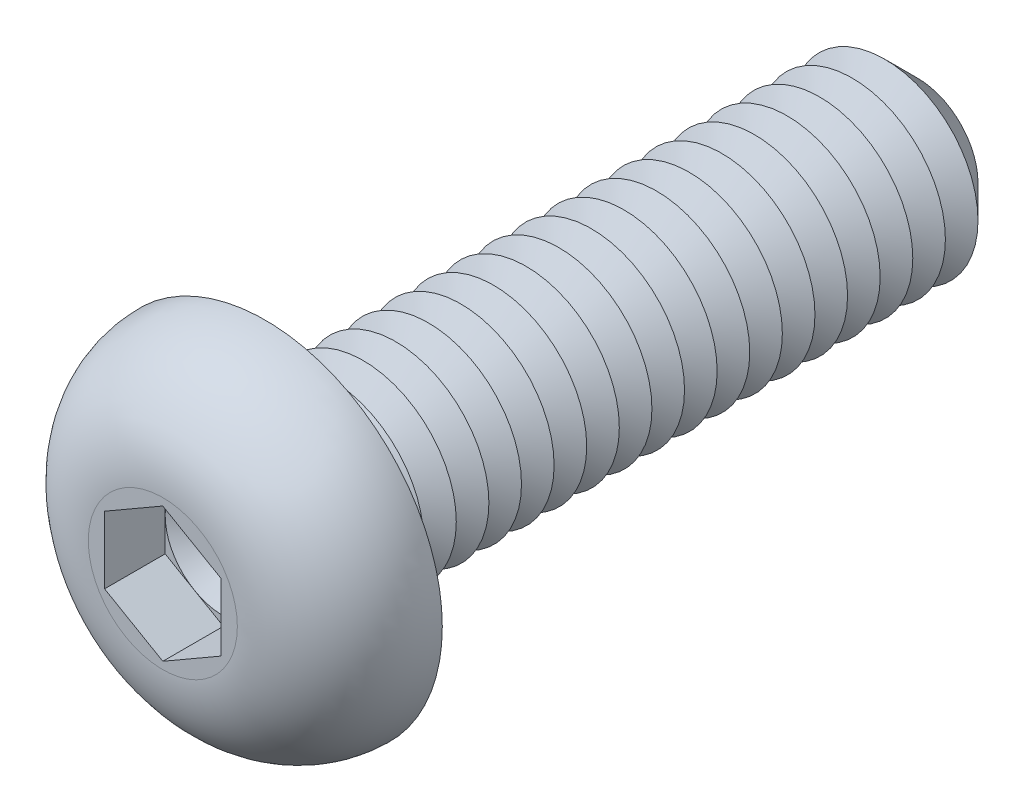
from build123d import *

# Parameters (mm, degrees)
CUT_EXTRUDE1_DEPTH  = 1.3
SKETCH4_R           = 2
BOSS_EXTRUDE1_DEPTH = 14
CHAMFER1_SIZE       = 0.7
LPATTERN1_COUNT     = 18
LPATTERN1_PITCH     = 0.7
FILLET2_R           = 0.3


with BuildPart() as part:
    # Sketch2 → Revolve1 (revolve)
    with BuildSketch(Plane(origin=(0, 0, 0), x_dir=(0, 0, -1), z_dir=(1, 0, 0)), mode=Mode.PRIVATE) as revolve1_sk:
        with BuildLine():
            Line((0, 0), (-2.2, 0))
            Line((-2.2, 0), (-2.2, 1.6))
            ThreePointArc((-2.2, 1.6), (-1.555634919, 3.155634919), (0, 3.8))
            Line((0, 3.8), (0, 0))
        make_face()
    revolve(revolve1_sk.sketch.rotate(Axis((0, 0, 47.934239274), (0, 0, -1)), 90), axis=Axis((0, 0, 47.934239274), (0, 0, -1)))

    # Sketch3 → Cut-Extrude1 (cut)
    with BuildSketch(Plane.XY.offset(2.2)):
        Polygon((0, 1.443375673), (-1.25, 0.721687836), (-1.25, -0.721687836), (0, -1.443375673), (1.25, -0.721687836), (1.25, 0.721687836), align=None)
    extrude(amount=-CUT_EXTRUDE1_DEPTH, mode=Mode.SUBTRACT)

    # Sketch4 → Boss-Extrude1 (add)
    with BuildSketch(Plane(origin=(0, 0, 0), x_dir=(-1, 0, 0), z_dir=(0, 0, -1))):
        with Locations(Location((0, 0, 0), (0, 0, 180))):
            Circle(SKETCH4_R)
    extrude(amount=BOSS_EXTRUDE1_DEPTH)

    # Chamfer1
    chamfer1_edges = [part.edges().sort_by_distance(p)[0] for p in [
        (-2, 0, -14),
    ]]
    chamfer(chamfer1_edges, length=CHAMFER1_SIZE)

    # Sketch5 → Cut-Revolve1 (revolve, cut)
    with BuildSketch(Plane(origin=(0, 0, 0), x_dir=(0, 0, -1), z_dir=(1, 0, 0)), mode=Mode.PRIVATE) as cut_revolve1_sk:
        Polygon((0.7, 2), (1.4, 2), (1.05, 1.393782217), align=None)
    cut_revolve1 = revolve(cut_revolve1_sk.sketch.rotate(Axis((0, 0, 47.934239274), (0, 0, -1)), 90), axis=Axis((0, 0, 47.934239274), (0, 0, -1)), mode=Mode.SUBTRACT)

    # LPattern1: Cut-Revolve1 ×18
    with Locations(*[(0, 0, -i * LPATTERN1_PITCH) for i in range(1, LPATTERN1_COUNT)]):
        add(cut_revolve1, mode=Mode.SUBTRACT)

    # Fillet2
    fillet2_edges = [part.edges().sort_by_distance(p)[0] for p in [
        (-2, 0, 0),
    ]]
    fillet(fillet2_edges, radius=FILLET2_R)

    # Cut-Extrude2 cone 1 section (on through the dimple's axis) → Cut-Extrude2 (revolve, cut)
    with BuildSketch(Plane(origin=(0, 0, 0.9), x_dir=(0, -1, 0), z_dir=(1, 0, 0))):
        Polygon((0, 0), (1.25, 0), (0, 0.721687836), align=None)
    revolve(axis=Axis((0, 0, 0.9), (0, 0, -1)), mode=Mode.SUBTRACT)


solid = part.part
